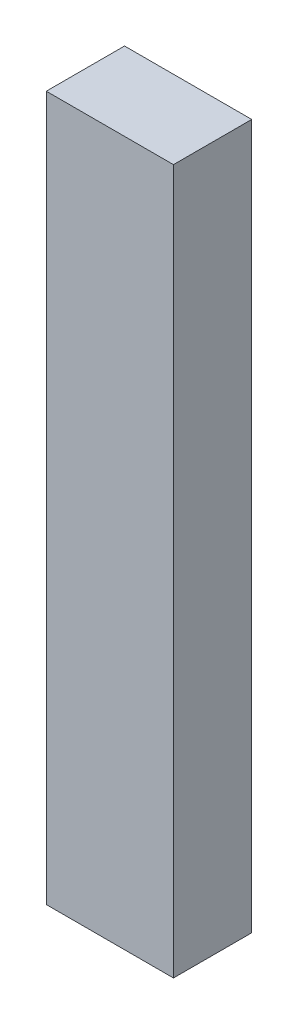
ISO-10303-21;
HEADER;
FILE_DESCRIPTION(('STEP AP214'),'2;1');
FILE_NAME('part.step','',(''),(''),'','','');
FILE_SCHEMA(('AUTOMOTIVE_DESIGN { 1 0 10303 214 1 1 1 1 }'));
ENDSEC;
DATA;
#1=APPLICATION_CONTEXT('core data for automotive mechanical design processes');
#2=APPLICATION_PROTOCOL_DEFINITION('international standard','automotive_design',2000,#1);
#3=PRODUCT_CONTEXT('',#1,'mechanical');
#4=PRODUCT('Part','Part','',(#3));
#5=PRODUCT_RELATED_PRODUCT_CATEGORY('part','',(#4));
#6=PRODUCT_DEFINITION_FORMATION('','',#4);
#7=PRODUCT_DEFINITION_CONTEXT('part definition',#1,'design');
#8=PRODUCT_DEFINITION('design','',#6,#7);
#9=PRODUCT_DEFINITION_SHAPE('','',#8);
#10=(LENGTH_UNIT() NAMED_UNIT(*) SI_UNIT(.MILLI.,.METRE.));
#11=(NAMED_UNIT(*) PLANE_ANGLE_UNIT() SI_UNIT($,.RADIAN.));
#12=(NAMED_UNIT(*) SI_UNIT($,.STERADIAN.) SOLID_ANGLE_UNIT());
#13=UNCERTAINTY_MEASURE_WITH_UNIT(LENGTH_MEASURE(1.E-05),#10,'distance_accuracy_value','');
#14=(GEOMETRIC_REPRESENTATION_CONTEXT(3) GLOBAL_UNCERTAINTY_ASSIGNED_CONTEXT((#13)) GLOBAL_UNIT_ASSIGNED_CONTEXT((#10,
#11,#12)) REPRESENTATION_CONTEXT('',''));
#15=CARTESIAN_POINT('',(0.,0.,0.));
#16=DIRECTION('',(0.,0.,1.));
#17=DIRECTION('',(1.,0.,0.));
#18=AXIS2_PLACEMENT_3D('',#15,#16,#17);
#19=CARTESIAN_POINT('',(41.275,457.2,-25.4));
#20=DIRECTION('',(-1.,0.,0.));
#21=DIRECTION('',(0.,0.,1.));
#22=AXIS2_PLACEMENT_3D('',#19,#20,#21);
#23=PLANE('',#22);
#24=DIRECTION('',(0.,0.,-1.));
#25=VECTOR('',#24,1.);
#26=CARTESIAN_POINT('',(41.275,0.,-25.4));
#27=LINE('',#26,#25);
#28=CARTESIAN_POINT('',(41.275,0.,25.4));
#29=VERTEX_POINT('',#28);
#30=CARTESIAN_POINT('',(41.275,0.,-25.4));
#31=VERTEX_POINT('',#30);
#32=EDGE_CURVE('E100',#29,#31,#27,.T.);
#33=ORIENTED_EDGE('',*,*,#32,.T.);
#34=DIRECTION('',(0.,-1.,0.));
#35=VECTOR('',#34,1.);
#36=CARTESIAN_POINT('',(41.275,457.2,-25.4));
#37=LINE('',#36,#35);
#38=CARTESIAN_POINT('',(41.275,457.2,-25.4));
#39=VERTEX_POINT('',#38);
#40=EDGE_CURVE('E11',#39,#31,#37,.T.);
#41=ORIENTED_EDGE('',*,*,#40,.F.);
#42=DIRECTION('',(0.,0.,-1.));
#43=VECTOR('',#42,1.);
#44=CARTESIAN_POINT('',(41.275,457.2,-25.4));
#45=LINE('',#44,#43);
#46=CARTESIAN_POINT('',(41.275,457.2,25.4));
#47=VERTEX_POINT('',#46);
#48=EDGE_CURVE('E88',#47,#39,#45,.T.);
#49=ORIENTED_EDGE('',*,*,#48,.F.);
#50=DIRECTION('',(0.,-1.,0.));
#51=VECTOR('',#50,1.);
#52=CARTESIAN_POINT('',(41.275,457.2,25.4));
#53=LINE('',#52,#51);
#54=EDGE_CURVE('E96',#47,#29,#53,.T.);
#55=ORIENTED_EDGE('',*,*,#54,.T.);
#56=EDGE_LOOP('',(#33,#41,#49,#55));
#57=FACE_BOUND('',#56,.T.);
#58=ADVANCED_FACE('F37',(#57),#23,.F.);
#59=CARTESIAN_POINT('',(-41.275,457.2,-25.4));
#60=DIRECTION('',(0.,0.,1.));
#61=DIRECTION('',(1.,0.,0.));
#62=AXIS2_PLACEMENT_3D('',#59,#60,#61);
#63=PLANE('',#62);
#64=DIRECTION('',(-1.,0.,0.));
#65=VECTOR('',#64,1.);
#66=CARTESIAN_POINT('',(-41.275,0.,-25.4));
#67=LINE('',#66,#65);
#68=CARTESIAN_POINT('',(-41.275,0.,-25.4));
#69=VERTEX_POINT('',#68);
#70=EDGE_CURVE('E92',#31,#69,#67,.T.);
#71=ORIENTED_EDGE('',*,*,#70,.T.);
#72=DIRECTION('',(0.,-1.,0.));
#73=VECTOR('',#72,1.);
#74=CARTESIAN_POINT('',(-41.275,457.2,-25.4));
#75=LINE('',#74,#73);
#76=CARTESIAN_POINT('',(-41.275,457.2,-25.4));
#77=VERTEX_POINT('',#76);
#78=EDGE_CURVE('E45',#77,#69,#75,.T.);
#79=ORIENTED_EDGE('',*,*,#78,.F.);
#80=DIRECTION('',(-1.,0.,0.));
#81=VECTOR('',#80,1.);
#82=CARTESIAN_POINT('',(-41.275,457.2,-25.4));
#83=LINE('',#82,#81);
#84=EDGE_CURVE('E83',#39,#77,#83,.T.);
#85=ORIENTED_EDGE('',*,*,#84,.F.);
#86=ORIENTED_EDGE('',*,*,#40,.T.);
#87=EDGE_LOOP('',(#71,#79,#85,#86));
#88=FACE_BOUND('',#87,.T.);
#89=ADVANCED_FACE('F91',(#88),#63,.F.);
#90=CARTESIAN_POINT('',(-41.275,457.2,-25.4));
#91=DIRECTION('',(1.,0.,0.));
#92=DIRECTION('',(0.,0.,-1.));
#93=AXIS2_PLACEMENT_3D('',#90,#91,#92);
#94=PLANE('',#93);
#95=DIRECTION('',(0.,0.,1.));
#96=VECTOR('',#95,1.);
#97=CARTESIAN_POINT('',(-41.275,0.,-25.4));
#98=LINE('',#97,#96);
#99=CARTESIAN_POINT('',(-41.275,0.,25.4));
#100=VERTEX_POINT('',#99);
#101=EDGE_CURVE('E70',#69,#100,#98,.T.);
#102=ORIENTED_EDGE('',*,*,#101,.T.);
#103=DIRECTION('',(0.,-1.,0.));
#104=VECTOR('',#103,1.);
#105=CARTESIAN_POINT('',(-41.275,457.2,25.4));
#106=LINE('',#105,#104);
#107=CARTESIAN_POINT('',(-41.275,457.2,25.4));
#108=VERTEX_POINT('',#107);
#109=EDGE_CURVE('E93',#108,#100,#106,.T.);
#110=ORIENTED_EDGE('',*,*,#109,.F.);
#111=DIRECTION('',(0.,0.,1.));
#112=VECTOR('',#111,1.);
#113=CARTESIAN_POINT('',(-41.275,457.2,-25.4));
#114=LINE('',#113,#112);
#115=EDGE_CURVE('E86',#77,#108,#114,.T.);
#116=ORIENTED_EDGE('',*,*,#115,.F.);
#117=ORIENTED_EDGE('',*,*,#78,.T.);
#118=EDGE_LOOP('',(#102,#110,#116,#117));
#119=FACE_BOUND('',#118,.T.);
#120=ADVANCED_FACE('F94',(#119),#94,.F.);
#121=CARTESIAN_POINT('',(-41.275,457.2,25.4));
#122=DIRECTION('',(0.,0.,-1.));
#123=DIRECTION('',(-1.,0.,0.));
#124=AXIS2_PLACEMENT_3D('',#121,#122,#123);
#125=PLANE('',#124);
#126=DIRECTION('',(1.,0.,0.));
#127=VECTOR('',#126,1.);
#128=CARTESIAN_POINT('',(-41.275,0.,25.4));
#129=LINE('',#128,#127);
#130=EDGE_CURVE('E76',#100,#29,#129,.T.);
#131=ORIENTED_EDGE('',*,*,#130,.T.);
#132=ORIENTED_EDGE('',*,*,#54,.F.);
#133=DIRECTION('',(1.,0.,0.));
#134=VECTOR('',#133,1.);
#135=CARTESIAN_POINT('',(-41.275,457.2,25.4));
#136=LINE('',#135,#134);
#137=EDGE_CURVE('E53',#108,#47,#136,.T.);
#138=ORIENTED_EDGE('',*,*,#137,.F.);
#139=ORIENTED_EDGE('',*,*,#109,.T.);
#140=EDGE_LOOP('',(#131,#132,#138,#139));
#141=FACE_BOUND('',#140,.T.);
#142=ADVANCED_FACE('F107',(#141),#125,.F.);
#143=CARTESIAN_POINT('',(0.,457.2,0.));
#144=DIRECTION('',(0.,1.,0.));
#145=DIRECTION('',(0.,0.,1.));
#146=AXIS2_PLACEMENT_3D('',#143,#144,#145);
#147=PLANE('',#146);
#148=ORIENTED_EDGE('',*,*,#48,.T.);
#149=ORIENTED_EDGE('',*,*,#84,.T.);
#150=ORIENTED_EDGE('',*,*,#115,.T.);
#151=ORIENTED_EDGE('',*,*,#137,.T.);
#152=EDGE_LOOP('',(#148,#149,#150,#151));
#153=FACE_BOUND('',#152,.T.);
#154=ADVANCED_FACE('F84',(#153),#147,.T.);
#155=CARTESIAN_POINT('',(0.,0.,0.));
#156=DIRECTION('',(0.,1.,0.));
#157=DIRECTION('',(0.,0.,1.));
#158=AXIS2_PLACEMENT_3D('',#155,#156,#157);
#159=PLANE('',#158);
#160=ORIENTED_EDGE('',*,*,#32,.F.);
#161=ORIENTED_EDGE('',*,*,#130,.F.);
#162=ORIENTED_EDGE('',*,*,#101,.F.);
#163=ORIENTED_EDGE('',*,*,#70,.F.);
#164=EDGE_LOOP('',(#160,#161,#162,#163));
#165=FACE_BOUND('',#164,.T.);
#166=ADVANCED_FACE('F110',(#165),#159,.F.);
#167=CLOSED_SHELL('',(#58,#89,#120,#142,#154,#166));
#168=MANIFOLD_SOLID_BREP('B2',#167);
#169=ADVANCED_BREP_SHAPE_REPRESENTATION('',(#18,#168),#14);
#170=SHAPE_DEFINITION_REPRESENTATION(#9,#169);
ENDSEC;
END-ISO-10303-21;
